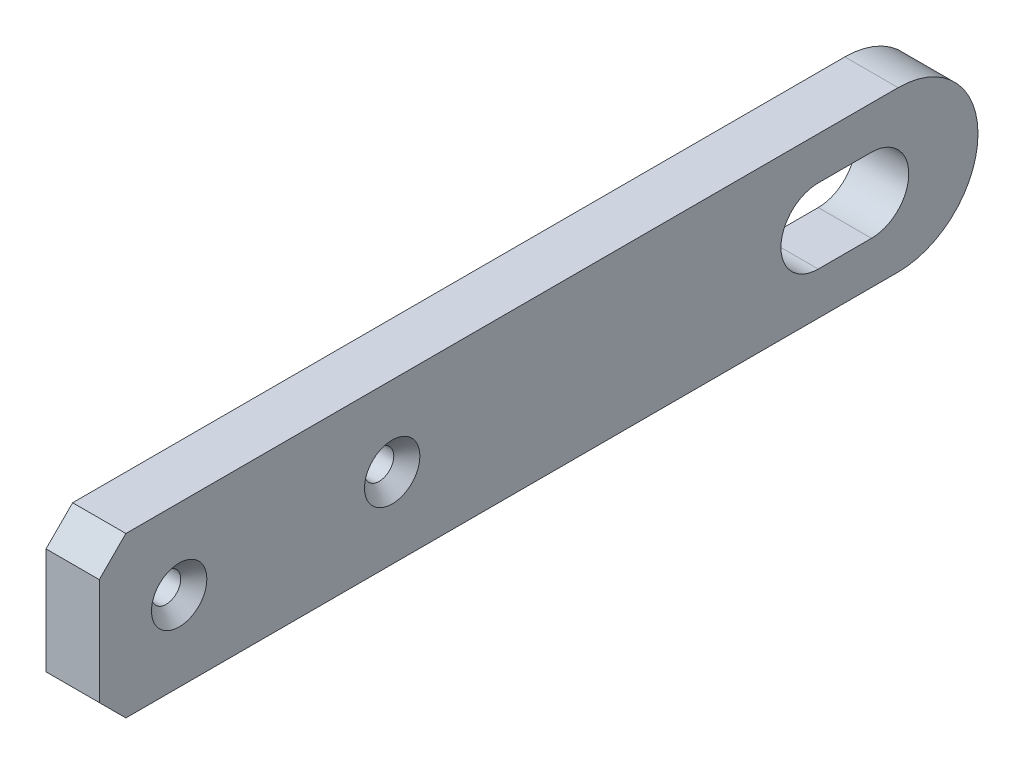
ISO-10303-21;
HEADER;
FILE_DESCRIPTION(('STEP AP214'),'2;1');
FILE_NAME('part.step','',(''),(''),'','','');
FILE_SCHEMA(('AUTOMOTIVE_DESIGN { 1 0 10303 214 1 1 1 1 }'));
ENDSEC;
DATA;
#1=APPLICATION_CONTEXT('core data for automotive mechanical design processes');
#2=APPLICATION_PROTOCOL_DEFINITION('international standard','automotive_design',2000,#1);
#3=PRODUCT_CONTEXT('',#1,'mechanical');
#4=PRODUCT('Part','Part','',(#3));
#5=PRODUCT_RELATED_PRODUCT_CATEGORY('part','',(#4));
#6=PRODUCT_DEFINITION_FORMATION('','',#4);
#7=PRODUCT_DEFINITION_CONTEXT('part definition',#1,'design');
#8=PRODUCT_DEFINITION('design','',#6,#7);
#9=PRODUCT_DEFINITION_SHAPE('','',#8);
#10=(LENGTH_UNIT() NAMED_UNIT(*) SI_UNIT(.MILLI.,.METRE.));
#11=(NAMED_UNIT(*) PLANE_ANGLE_UNIT() SI_UNIT($,.RADIAN.));
#12=(NAMED_UNIT(*) SI_UNIT($,.STERADIAN.) SOLID_ANGLE_UNIT());
#13=UNCERTAINTY_MEASURE_WITH_UNIT(LENGTH_MEASURE(1.E-05),#10,'distance_accuracy_value','');
#14=(GEOMETRIC_REPRESENTATION_CONTEXT(3) GLOBAL_UNCERTAINTY_ASSIGNED_CONTEXT((#13)) GLOBAL_UNIT_ASSIGNED_CONTEXT((#10,
#11,#12)) REPRESENTATION_CONTEXT('',''));
#15=CARTESIAN_POINT('',(0.,0.,0.));
#16=DIRECTION('',(0.,0.,1.));
#17=DIRECTION('',(1.,0.,0.));
#18=AXIS2_PLACEMENT_3D('',#15,#16,#17);
#19=CARTESIAN_POINT('',(6.00000000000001,-5.25947139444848,-317.315712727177));
#20=DIRECTION('',(0.,1.,0.));
#21=DIRECTION('',(0.,0.,1.));
#22=AXIS2_PLACEMENT_3D('',#19,#20,#21);
#23=PLANE('',#22);
#24=DIRECTION('',(-1.,0.,0.));
#25=VECTOR('',#24,1.);
#26=CARTESIAN_POINT('',(6.00000000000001,-5.25947139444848,-327.315712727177));
#27=LINE('',#26,#25);
#28=CARTESIAN_POINT('',(0.964159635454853,-5.25947139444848,-327.315712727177));
#29=VERTEX_POINT('',#28);
#30=CARTESIAN_POINT('',(-3.99999999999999,-5.25947139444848,-327.315712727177));
#31=VERTEX_POINT('',#30);
#32=EDGE_CURVE('E148',#29,#31,#27,.T.);
#33=ORIENTED_EDGE('',*,*,#32,.F.);
#34=DIRECTION('',(0.,0.,1.));
#35=VECTOR('',#34,1.);
#36=CARTESIAN_POINT('',(0.964159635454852,-5.25947139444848,-302.758317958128));
#37=LINE('',#36,#35);
#38=CARTESIAN_POINT('',(0.964159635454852,-5.25947139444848,-317.315712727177));
#39=VERTEX_POINT('',#38);
#40=EDGE_CURVE('E127',#29,#39,#37,.T.);
#41=ORIENTED_EDGE('',*,*,#40,.T.);
#42=DIRECTION('',(-1.,0.,0.));
#43=VECTOR('',#42,1.);
#44=CARTESIAN_POINT('',(6.00000000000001,-5.25947139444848,-317.315712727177));
#45=LINE('',#44,#43);
#46=CARTESIAN_POINT('',(-3.99999999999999,-5.25947139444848,-317.315712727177));
#47=VERTEX_POINT('',#46);
#48=EDGE_CURVE('E158',#39,#47,#45,.T.);
#49=ORIENTED_EDGE('',*,*,#48,.T.);
#50=DIRECTION('',(0.,0.,-1.));
#51=VECTOR('',#50,1.);
#52=CARTESIAN_POINT('',(-3.99999999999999,-5.25947139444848,-317.315712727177));
#53=LINE('',#52,#51);
#54=EDGE_CURVE('E155',#47,#31,#53,.T.);
#55=ORIENTED_EDGE('',*,*,#54,.T.);
#56=EDGE_LOOP('',(#33,#41,#49,#55));
#57=FACE_BOUND('',#56,.T.);
#58=ADVANCED_FACE('F33',(#57),#23,.F.);
#59=CARTESIAN_POINT('',(-3.99999999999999,-12.2594713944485,-332.315712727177));
#60=DIRECTION('',(1.,0.,0.));
#61=DIRECTION('',(0.,0.,-1.));
#62=AXIS2_PLACEMENT_3D('',#59,#60,#61);
#63=CYLINDRICAL_SURFACE('',#62,15.);
#64=CARTESIAN_POINT('',(5.04999999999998,-5.50000000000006,-345.706364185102));
#65=CARTESIAN_POINT('',(5.04999921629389,-5.61966680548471,-345.766771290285));
#66=CARTESIAN_POINT('',(5.0395139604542,-5.74015633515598,-345.825563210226));
#67=CARTESIAN_POINT('',(4.99683186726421,-5.97950495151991,-345.938469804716));
#68=CARTESIAN_POINT('',(4.96464119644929,-6.09836449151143,-345.992585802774));
#69=CARTESIAN_POINT('',(4.87809843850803,-6.33109425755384,-346.095066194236));
#70=CARTESIAN_POINT('',(4.8236549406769,-6.44494173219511,-346.143405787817));
#71=CARTESIAN_POINT('',(4.69315955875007,-6.66266729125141,-346.232955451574));
#72=CARTESIAN_POINT('',(4.61711540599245,-6.76654892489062,-346.274168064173));
#73=CARTESIAN_POINT('',(4.45189059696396,-6.95214614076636,-346.345731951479));
#74=CARTESIAN_POINT('',(4.36420231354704,-7.03495986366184,-346.376680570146));
#75=CARTESIAN_POINT('',(4.17424353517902,-7.18471289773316,-346.431420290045));
#76=CARTESIAN_POINT('',(4.07197971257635,-7.25165943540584,-346.455214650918));
#77=CARTESIAN_POINT('',(3.86383422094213,-7.36257631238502,-346.493993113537));
#78=CARTESIAN_POINT('',(3.75874191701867,-7.40785297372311,-346.509487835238));
#79=CARTESIAN_POINT('',(3.54181305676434,-7.48040586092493,-346.534081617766));
#80=CARTESIAN_POINT('',(3.42997818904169,-7.5076865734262,-346.543182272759));
#81=CARTESIAN_POINT('',(3.20724181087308,-7.54249472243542,-346.554759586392));
#82=CARTESIAN_POINT('',(3.09646109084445,-7.55072102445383,-346.557470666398));
#83=CARTESIAN_POINT('',(2.87504375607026,-7.54917995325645,-346.556961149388));
#84=CARTESIAN_POINT('',(2.76440712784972,-7.53941440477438,-346.553741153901));
#85=CARTESIAN_POINT('',(2.54767494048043,-7.50246267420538,-346.541437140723));
#86=CARTESIAN_POINT('',(2.44154302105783,-7.4754675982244,-346.532417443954));
#87=CARTESIAN_POINT('',(2.2355005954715,-7.40522646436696,-346.508586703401));
#88=CARTESIAN_POINT('',(2.13559005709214,-7.36198049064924,-346.493775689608));
#89=CARTESIAN_POINT('',(1.94370756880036,-7.26029827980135,-346.458243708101));
#90=CARTESIAN_POINT('',(1.85182210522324,-7.20171864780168,-346.437466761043));
#91=CARTESIAN_POINT('',(1.67936848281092,-7.07165577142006,-346.39020540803));
#92=CARTESIAN_POINT('',(1.59880142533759,-7.00017127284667,-346.36372044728));
#93=CARTESIAN_POINT('',(1.4482985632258,-6.84419045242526,-346.304347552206));
#94=CARTESIAN_POINT('',(1.3787968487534,-6.75934492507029,-346.271278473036));
#95=CARTESIAN_POINT('',(1.25497448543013,-6.58127562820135,-346.199779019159));
#96=CARTESIAN_POINT('',(1.20065732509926,-6.48804993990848,-346.161347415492));
#97=CARTESIAN_POINT('',(1.10500449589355,-6.29012544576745,-346.07722238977));
#98=CARTESIAN_POINT('',(1.06466543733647,-6.1850736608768,-346.031228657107));
#99=CARTESIAN_POINT('',(1.00191761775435,-5.97174574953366,-345.934751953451));
#100=CARTESIAN_POINT('',(0.979515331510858,-5.86346847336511,-345.884267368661));
#101=CARTESIAN_POINT('',(0.95112881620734,-5.63696420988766,-345.775263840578));
#102=CARTESIAN_POINT('',(0.946740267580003,-5.51869016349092,-345.716427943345));
#103=CARTESIAN_POINT('',(0.95798582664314,-5.28450625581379,-345.596045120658));
#104=CARTESIAN_POINT('',(0.973627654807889,-5.1685973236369,-345.534497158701));
#105=CARTESIAN_POINT('',(1.02629302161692,-4.93169752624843,-345.40477345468));
#106=CARTESIAN_POINT('',(1.06507272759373,-4.81115352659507,-345.336490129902));
#107=CARTESIAN_POINT('',(1.16432700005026,-4.57869939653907,-345.200738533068));
#108=CARTESIAN_POINT('',(1.22482012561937,-4.46679675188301,-345.13327100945));
#109=CARTESIAN_POINT('',(1.3689333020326,-4.25120809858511,-344.999730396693));
#110=CARTESIAN_POINT('',(1.45323792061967,-4.147904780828,-344.93377293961));
#111=CARTESIAN_POINT('',(1.64303645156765,-3.95755248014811,-344.809352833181));
#112=CARTESIAN_POINT('',(1.74849351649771,-3.87047573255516,-344.750877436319));
#113=CARTESIAN_POINT('',(1.94691790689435,-3.73831137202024,-344.660525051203));
#114=CARTESIAN_POINT('',(2.03528677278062,-3.68826956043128,-344.625762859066));
#115=CARTESIAN_POINT('',(2.2208610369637,-3.60107287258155,-344.564589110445));
#116=CARTESIAN_POINT('',(2.3180588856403,-3.56390711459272,-344.53817050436));
#117=CARTESIAN_POINT('',(2.51979764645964,-3.50424561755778,-344.495507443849));
#118=CARTESIAN_POINT('',(2.62438354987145,-3.48185022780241,-344.479332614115));
#119=CARTESIAN_POINT('',(2.83691267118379,-3.45369430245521,-344.458966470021));
#120=CARTESIAN_POINT('',(2.94485383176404,-3.44792376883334,-344.454767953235));
#121=CARTESIAN_POINT('',(3.14795907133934,-3.45310977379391,-344.458528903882));
#122=CARTESIAN_POINT('',(3.2432010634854,-3.46226647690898,-344.465180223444));
#123=CARTESIAN_POINT('',(3.43041100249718,-3.49344782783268,-344.487696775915));
#124=CARTESIAN_POINT('',(3.52237875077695,-3.5154732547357,-344.503562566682));
#125=CARTESIAN_POINT('',(3.70102059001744,-3.57130631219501,-344.543425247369));
#126=CARTESIAN_POINT('',(3.78768040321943,-3.60514421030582,-344.567443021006));
#127=CARTESIAN_POINT('',(3.95391994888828,-3.68314079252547,-344.62216706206));
#128=CARTESIAN_POINT('',(4.0334971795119,-3.72730310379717,-344.652875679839));
#129=CARTESIAN_POINT('',(4.19468829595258,-3.83099191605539,-344.723983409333));
#130=CARTESIAN_POINT('',(4.27515665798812,-3.89178231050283,-344.765128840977));
#131=CARTESIAN_POINT('',(4.42495212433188,-4.02286315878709,-344.852238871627));
#132=CARTESIAN_POINT('',(4.49427249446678,-4.09315930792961,-344.898206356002));
#133=CARTESIAN_POINT('',(4.63256613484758,-4.25482653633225,-345.001784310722));
#134=CARTESIAN_POINT('',(4.69929570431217,-4.34772394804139,-345.060013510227));
#135=CARTESIAN_POINT('',(4.81604513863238,-4.54220999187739,-345.178717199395));
#136=CARTESIAN_POINT('',(4.86605297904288,-4.64380481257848,-345.239193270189));
#137=CARTESIAN_POINT('',(4.95416351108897,-4.86751587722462,-345.368596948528));
#138=CARTESIAN_POINT('',(4.9898187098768,-4.99056958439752,-345.437585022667));
#139=CARTESIAN_POINT('',(5.03773595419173,-5.24209513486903,-345.573799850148));
#140=CARTESIAN_POINT('',(5.05000084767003,-5.37056631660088,-345.641026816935));
#141=CARTESIAN_POINT('',(5.04999999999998,-5.50000000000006,-345.706364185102));
#142=B_SPLINE_CURVE_WITH_KNOTS('',3,(#64,#65,#66,#67,#68,#69,#70,#71,#72,#73,#74,#75,#76,#77,
#78,#79,#80,#81,#82,#83,#84,#85,#86,#87,#88,#89,#90,#91,#92,#93,#94,#95,#96,#97,#98,#99,#100,
#101,#102,#103,#104,#105,#106,#107,#108,#109,#110,#111,#112,#113,#114,#115,#116,#117,#118,#119,
#120,#121,#122,#123,#124,#125,#126,#127,#128,#129,#130,#131,#132,#133,#134,#135,#136,#137,#138,
#139,#140,#141),.UNSPECIFIED.,.T.,.F.,(4,2,2,2,2,2,2,2,2,2,2,2,2,2,2,2,2,2,2,2,2,2,2,2,2,2,2,2,
2,2,2,2,2,2,2,2,2,2,4),(0.,0.401696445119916,0.803278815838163,1.20652766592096,
1.60963236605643,1.98121315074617,2.35262437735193,2.69731942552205,3.04192850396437,
3.37368320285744,3.70540425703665,4.03350840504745,4.36161085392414,4.692898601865,
5.02421856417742,5.36637891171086,5.70861780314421,6.07177906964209,6.43507137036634,
6.82992980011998,7.22494046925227,7.6546210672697,8.08466980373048,8.52862433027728,
8.97181210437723,9.29256060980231,9.61303738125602,9.93566962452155,10.258107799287,
10.5444581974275,10.8308259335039,11.1179328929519,11.40514087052,11.7306787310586,
12.0564125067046,12.43993877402,12.8237402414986,13.2582749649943,13.6927567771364),.UNSPECIFIED.);
#143=CARTESIAN_POINT('',(5.04999999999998,-5.50000000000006,-345.706364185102));
#144=VERTEX_POINT('',#143);
#145=EDGE_CURVE('E215',#144,#144,#142,.T.);
#146=ORIENTED_EDGE('',*,*,#145,.F.);
#147=EDGE_LOOP('',(#146));
#148=FACE_BOUND('',#147,.T.);
#149=CARTESIAN_POINT('',(6.00000000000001,-12.2594713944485,-332.315712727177));
#150=DIRECTION('',(1.,0.,0.));
#151=DIRECTION('',(0.,0.,-1.));
#152=AXIS2_PLACEMENT_3D('',#149,#150,#151);
#153=CIRCLE('',#152,15.);
#154=CARTESIAN_POINT('',(6.00000000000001,-27.2594713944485,-332.315712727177));
#155=VERTEX_POINT('',#154);
#156=CARTESIAN_POINT('',(6.00000000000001,2.74052860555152,-332.315712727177));
#157=VERTEX_POINT('',#156);
#158=EDGE_CURVE('E147',#155,#157,#153,.T.);
#159=ORIENTED_EDGE('',*,*,#158,.F.);
#160=DIRECTION('',(1.,0.,0.));
#161=VECTOR('',#160,1.);
#162=CARTESIAN_POINT('',(-3.99999999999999,-27.2594713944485,-332.315712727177));
#163=LINE('',#162,#161);
#164=CARTESIAN_POINT('',(-3.99999999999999,-27.2594713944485,-332.315712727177));
#165=VERTEX_POINT('',#164);
#166=EDGE_CURVE('E132',#165,#155,#163,.T.);
#167=ORIENTED_EDGE('',*,*,#166,.F.);
#168=CARTESIAN_POINT('',(-3.99999999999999,-12.2594713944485,-332.315712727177));
#169=DIRECTION('',(1.,0.,0.));
#170=DIRECTION('',(0.,0.,-1.));
#171=AXIS2_PLACEMENT_3D('',#168,#169,#170);
#172=CIRCLE('',#171,15.);
#173=CARTESIAN_POINT('',(-3.99999999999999,2.74052860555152,-332.315712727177));
#174=VERTEX_POINT('',#173);
#175=EDGE_CURVE('E165',#165,#174,#172,.T.);
#176=ORIENTED_EDGE('',*,*,#175,.T.);
#177=DIRECTION('',(1.,0.,0.));
#178=VECTOR('',#177,1.);
#179=CARTESIAN_POINT('',(-3.99999999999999,2.74052860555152,-332.315712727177));
#180=LINE('',#179,#178);
#181=EDGE_CURVE('E175',#174,#157,#180,.T.);
#182=ORIENTED_EDGE('',*,*,#181,.T.);
#183=EDGE_LOOP('',(#159,#167,#176,#182));
#184=FACE_BOUND('',#183,.T.);
#185=ADVANCED_FACE('F230',(#148,#184),#63,.T.);
#186=CARTESIAN_POINT('',(-3.99999999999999,-27.2594713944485,-182.315712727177));
#187=DIRECTION('',(0.,-1.,0.));
#188=DIRECTION('',(0.,0.,-1.));
#189=AXIS2_PLACEMENT_3D('',#186,#187,#188);
#190=PLANE('',#189);
#191=DIRECTION('',(0.,0.,-1.));
#192=VECTOR('',#191,1.);
#193=CARTESIAN_POINT('',(6.00000000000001,-27.2594713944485,-182.315712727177));
#194=LINE('',#193,#192);
#195=CARTESIAN_POINT('',(6.00000000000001,-27.2594713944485,-187.315712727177));
#196=VERTEX_POINT('',#195);
#197=EDGE_CURVE('E169',#196,#155,#194,.T.);
#198=ORIENTED_EDGE('',*,*,#197,.F.);
#199=DIRECTION('',(-1.,0.,0.));
#200=VECTOR('',#199,1.);
#201=CARTESIAN_POINT('',(-3.99999999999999,-27.2594713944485,-187.315712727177));
#202=LINE('',#201,#200);
#203=CARTESIAN_POINT('',(-3.99999999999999,-27.2594713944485,-187.315712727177));
#204=VERTEX_POINT('',#203);
#205=EDGE_CURVE('E11',#196,#204,#202,.T.);
#206=ORIENTED_EDGE('',*,*,#205,.T.);
#207=DIRECTION('',(0.,0.,-1.));
#208=VECTOR('',#207,1.);
#209=CARTESIAN_POINT('',(-3.99999999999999,-27.2594713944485,-182.315712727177));
#210=LINE('',#209,#208);
#211=EDGE_CURVE('E174',#204,#165,#210,.T.);
#212=ORIENTED_EDGE('',*,*,#211,.T.);
#213=ORIENTED_EDGE('',*,*,#166,.T.);
#214=EDGE_LOOP('',(#198,#206,#212,#213));
#215=FACE_BOUND('',#214,.T.);
#216=ADVANCED_FACE('F235',(#215),#190,.T.);
#217=CARTESIAN_POINT('',(-3.99999999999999,2.7405286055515,-182.315712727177));
#218=DIRECTION('',(0.,0.,1.));
#219=DIRECTION('',(1.,0.,0.));
#220=AXIS2_PLACEMENT_3D('',#217,#218,#219);
#221=PLANE('',#220);
#222=DIRECTION('',(0.,-1.,0.));
#223=VECTOR('',#222,1.);
#224=CARTESIAN_POINT('',(6.00000000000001,2.7405286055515,-182.315712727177));
#225=LINE('',#224,#223);
#226=CARTESIAN_POINT('',(6.00000000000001,-2.25947139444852,-182.315712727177));
#227=VERTEX_POINT('',#226);
#228=CARTESIAN_POINT('',(6.00000000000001,-22.2594713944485,-182.315712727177));
#229=VERTEX_POINT('',#228);
#230=EDGE_CURVE('E179',#227,#229,#225,.T.);
#231=ORIENTED_EDGE('',*,*,#230,.F.);
#232=DIRECTION('',(-1.,0.,0.));
#233=VECTOR('',#232,1.);
#234=CARTESIAN_POINT('',(-3.99999999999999,-2.25947139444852,-182.315712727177));
#235=LINE('',#234,#233);
#236=CARTESIAN_POINT('',(-3.99999999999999,-2.25947139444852,-182.315712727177));
#237=VERTEX_POINT('',#236);
#238=EDGE_CURVE('E280',#227,#237,#235,.T.);
#239=ORIENTED_EDGE('',*,*,#238,.T.);
#240=DIRECTION('',(0.,-1.,0.));
#241=VECTOR('',#240,1.);
#242=CARTESIAN_POINT('',(-3.99999999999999,2.7405286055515,-182.315712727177));
#243=LINE('',#242,#241);
#244=CARTESIAN_POINT('',(-3.99999999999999,-22.2594713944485,-182.315712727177));
#245=VERTEX_POINT('',#244);
#246=EDGE_CURVE('E172',#237,#245,#243,.T.);
#247=ORIENTED_EDGE('',*,*,#246,.T.);
#248=DIRECTION('',(1.,0.,0.));
#249=VECTOR('',#248,1.);
#250=CARTESIAN_POINT('',(-3.99999999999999,-22.2594713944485,-182.315712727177));
#251=LINE('',#250,#249);
#252=EDGE_CURVE('E286',#245,#229,#251,.T.);
#253=ORIENTED_EDGE('',*,*,#252,.T.);
#254=EDGE_LOOP('',(#231,#239,#247,#253));
#255=FACE_BOUND('',#254,.T.);
#256=ADVANCED_FACE('F258',(#255),#221,.T.);
#257=CARTESIAN_POINT('',(-3.99999999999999,2.74052860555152,-332.315712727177));
#258=DIRECTION('',(0.,1.,0.));
#259=DIRECTION('',(0.,0.,1.));
#260=AXIS2_PLACEMENT_3D('',#257,#258,#259);
#261=PLANE('',#260);
#262=DIRECTION('',(0.,0.,1.));
#263=VECTOR('',#262,1.);
#264=CARTESIAN_POINT('',(-3.99999999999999,2.74052860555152,-332.315712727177));
#265=LINE('',#264,#263);
#266=CARTESIAN_POINT('',(-3.99999999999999,2.7405286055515,-187.315712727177));
#267=VERTEX_POINT('',#266);
#268=EDGE_CURVE('E168',#174,#267,#265,.T.);
#269=ORIENTED_EDGE('',*,*,#268,.T.);
#270=DIRECTION('',(1.,0.,0.));
#271=VECTOR('',#270,1.);
#272=CARTESIAN_POINT('',(-3.99999999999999,2.7405286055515,-187.315712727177));
#273=LINE('',#272,#271);
#274=CARTESIAN_POINT('',(6.00000000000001,2.7405286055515,-187.315712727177));
#275=VERTEX_POINT('',#274);
#276=EDGE_CURVE('E131',#267,#275,#273,.T.);
#277=ORIENTED_EDGE('',*,*,#276,.T.);
#278=DIRECTION('',(0.,0.,1.));
#279=VECTOR('',#278,1.);
#280=CARTESIAN_POINT('',(6.00000000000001,2.74052860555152,-332.315712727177));
#281=LINE('',#280,#279);
#282=EDGE_CURVE('E151',#157,#275,#281,.T.);
#283=ORIENTED_EDGE('',*,*,#282,.F.);
#284=ORIENTED_EDGE('',*,*,#181,.F.);
#285=EDGE_LOOP('',(#269,#277,#283,#284));
#286=FACE_BOUND('',#285,.T.);
#287=ADVANCED_FACE('F251',(#286),#261,.T.);
#288=CARTESIAN_POINT('',(-3.99999999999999,-12.2594713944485,-332.315712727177));
#289=DIRECTION('',(1.,0.,0.));
#290=DIRECTION('',(0.,0.,-1.));
#291=AXIS2_PLACEMENT_3D('',#288,#289,#290);
#292=PLANE('',#291);
#293=CARTESIAN_POINT('',(-3.99999999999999,-12.2594713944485,-197.315712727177));
#294=DIRECTION('',(1.,0.,0.));
#295=DIRECTION('',(0.,0.,-1.));
#296=AXIS2_PLACEMENT_3D('',#293,#294,#295);
#297=CIRCLE('',#296,2.74999999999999);
#298=CARTESIAN_POINT('',(-3.99999999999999,-12.2594713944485,-200.065712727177));
#299=VERTEX_POINT('',#298);
#300=EDGE_CURVE('E320',#299,#299,#297,.T.);
#301=ORIENTED_EDGE('',*,*,#300,.T.);
#302=EDGE_LOOP('',(#301));
#303=FACE_BOUND('',#302,.T.);
#304=CARTESIAN_POINT('',(-3.99999999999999,-12.2594713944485,-237.315712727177));
#305=DIRECTION('',(1.,0.,0.));
#306=DIRECTION('',(0.,0.,-1.));
#307=AXIS2_PLACEMENT_3D('',#304,#305,#306);
#308=CIRCLE('',#307,2.74999999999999);
#309=CARTESIAN_POINT('',(-3.99999999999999,-12.2594713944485,-240.065712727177));
#310=VERTEX_POINT('',#309);
#311=EDGE_CURVE('E322',#310,#310,#308,.T.);
#312=ORIENTED_EDGE('',*,*,#311,.T.);
#313=EDGE_LOOP('',(#312));
#314=FACE_BOUND('',#313,.T.);
#315=DIRECTION('',(0.,0.,1.));
#316=VECTOR('',#315,1.);
#317=CARTESIAN_POINT('',(-3.99999999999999,-19.2594713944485,-327.315712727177));
#318=LINE('',#317,#316);
#319=CARTESIAN_POINT('',(-3.99999999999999,-19.2594713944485,-327.315712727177));
#320=VERTEX_POINT('',#319);
#321=CARTESIAN_POINT('',(-3.99999999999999,-19.2594713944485,-317.315712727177));
#322=VERTEX_POINT('',#321);
#323=EDGE_CURVE('E441',#320,#322,#318,.T.);
#324=ORIENTED_EDGE('',*,*,#323,.F.);
#325=CARTESIAN_POINT('',(-3.99999999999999,-12.2594713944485,-327.315712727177));
#326=DIRECTION('',(-1.,0.,0.));
#327=DIRECTION('',(0.,0.,1.));
#328=AXIS2_PLACEMENT_3D('',#325,#326,#327);
#329=CIRCLE('',#328,7.00000000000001);
#330=EDGE_CURVE('E443',#31,#320,#329,.T.);
#331=ORIENTED_EDGE('',*,*,#330,.F.);
#332=ORIENTED_EDGE('',*,*,#54,.F.);
#333=CARTESIAN_POINT('',(-3.99999999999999,-12.2594713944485,-317.315712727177));
#334=DIRECTION('',(-1.,0.,0.));
#335=DIRECTION('',(0.,0.,1.));
#336=AXIS2_PLACEMENT_3D('',#333,#334,#335);
#337=CIRCLE('',#336,7.);
#338=EDGE_CURVE('E445',#322,#47,#337,.T.);
#339=ORIENTED_EDGE('',*,*,#338,.F.);
#340=EDGE_LOOP('',(#324,#331,#332,#339));
#341=FACE_BOUND('',#340,.T.);
#342=ORIENTED_EDGE('',*,*,#246,.F.);
#343=DIRECTION('',(0.,-0.70710678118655,0.707106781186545));
#344=VECTOR('',#343,1.);
#345=CARTESIAN_POINT('',(-3.99999999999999,2.7405286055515,-187.315712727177));
#346=LINE('',#345,#344);
#347=EDGE_CURVE('E41',#237,#267,#346,.F.);
#348=ORIENTED_EDGE('',*,*,#347,.T.);
#349=ORIENTED_EDGE('',*,*,#268,.F.);
#350=ORIENTED_EDGE('',*,*,#175,.F.);
#351=ORIENTED_EDGE('',*,*,#211,.F.);
#352=DIRECTION('',(0.,-0.707106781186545,-0.70710678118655));
#353=VECTOR('',#352,1.);
#354=CARTESIAN_POINT('',(-3.99999999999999,-22.2594713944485,-182.315712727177));
#355=LINE('',#354,#353);
#356=EDGE_CURVE('E53',#204,#245,#355,.F.);
#357=ORIENTED_EDGE('',*,*,#356,.T.);
#358=EDGE_LOOP('',(#342,#348,#349,#350,#351,#357));
#359=FACE_BOUND('',#358,.T.);
#360=ADVANCED_FACE('F245',(#303,#314,#341,#359),#292,.F.);
#361=CARTESIAN_POINT('',(6.00000000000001,-12.2594713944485,-332.315712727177));
#362=DIRECTION('',(1.,0.,0.));
#363=DIRECTION('',(0.,0.,-1.));
#364=AXIS2_PLACEMENT_3D('',#361,#362,#363);
#365=PLANE('',#364);
#366=CARTESIAN_POINT('',(6.00000000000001,-12.2594713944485,-197.315712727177));
#367=DIRECTION('',(1.,0.,0.));
#368=DIRECTION('',(0.,0.,-1.));
#369=AXIS2_PLACEMENT_3D('',#366,#367,#368);
#370=CIRCLE('',#369,5.20000000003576);
#371=CARTESIAN_POINT('',(6.00000000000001,-12.2594713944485,-202.515712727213));
#372=VERTEX_POINT('',#371);
#373=EDGE_CURVE('E464',#372,#372,#370,.T.);
#374=ORIENTED_EDGE('',*,*,#373,.F.);
#375=EDGE_LOOP('',(#374));
#376=FACE_BOUND('',#375,.T.);
#377=CARTESIAN_POINT('',(6.00000000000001,-12.2594713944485,-237.315712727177));
#378=DIRECTION('',(1.,0.,0.));
#379=DIRECTION('',(0.,0.,-1.));
#380=AXIS2_PLACEMENT_3D('',#377,#378,#379);
#381=CIRCLE('',#380,5.20000000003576);
#382=CARTESIAN_POINT('',(6.00000000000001,-12.2594713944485,-242.515712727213));
#383=VERTEX_POINT('',#382);
#384=EDGE_CURVE('E319',#383,#383,#381,.T.);
#385=ORIENTED_EDGE('',*,*,#384,.F.);
#386=EDGE_LOOP('',(#385));
#387=FACE_BOUND('',#386,.T.);
#388=CARTESIAN_POINT('',(6.00000000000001,-12.2594713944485,-327.315712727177));
#389=DIRECTION('',(-1.,0.,0.));
#390=DIRECTION('',(0.,0.,1.));
#391=AXIS2_PLACEMENT_3D('',#388,#389,#390);
#392=CIRCLE('',#391,7.00000000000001);
#393=CARTESIAN_POINT('',(6.00000000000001,-5.25947139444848,-327.315712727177));
#394=VERTEX_POINT('',#393);
#395=CARTESIAN_POINT('',(6.00000000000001,-19.2594713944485,-327.315712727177));
#396=VERTEX_POINT('',#395);
#397=EDGE_CURVE('E145',#394,#396,#392,.T.);
#398=ORIENTED_EDGE('',*,*,#397,.T.);
#399=DIRECTION('',(0.,0.,1.));
#400=VECTOR('',#399,1.);
#401=CARTESIAN_POINT('',(6.00000000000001,-19.2594713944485,-327.315712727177));
#402=LINE('',#401,#400);
#403=CARTESIAN_POINT('',(6.00000000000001,-19.2594713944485,-317.315712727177));
#404=VERTEX_POINT('',#403);
#405=EDGE_CURVE('E454',#396,#404,#402,.T.);
#406=ORIENTED_EDGE('',*,*,#405,.T.);
#407=CARTESIAN_POINT('',(6.00000000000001,-12.2594713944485,-317.315712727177));
#408=DIRECTION('',(-1.,0.,0.));
#409=DIRECTION('',(0.,0.,1.));
#410=AXIS2_PLACEMENT_3D('',#407,#408,#409);
#411=CIRCLE('',#410,7.);
#412=CARTESIAN_POINT('',(6.00000000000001,-5.25947139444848,-317.315712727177));
#413=VERTEX_POINT('',#412);
#414=EDGE_CURVE('E451',#404,#413,#411,.T.);
#415=ORIENTED_EDGE('',*,*,#414,.T.);
#416=DIRECTION('',(0.,0.,-1.));
#417=VECTOR('',#416,1.);
#418=CARTESIAN_POINT('',(6.00000000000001,-5.25947139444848,-317.315712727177));
#419=LINE('',#418,#417);
#420=EDGE_CURVE('E164',#413,#394,#419,.T.);
#421=ORIENTED_EDGE('',*,*,#420,.T.);
#422=EDGE_LOOP('',(#398,#406,#415,#421));
#423=FACE_BOUND('',#422,.T.);
#424=ORIENTED_EDGE('',*,*,#282,.T.);
#425=DIRECTION('',(0.,0.70710678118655,-0.707106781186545));
#426=VECTOR('',#425,1.);
#427=CARTESIAN_POINT('',(6.00000000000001,67.7405286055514,-252.315712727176));
#428=LINE('',#427,#426);
#429=EDGE_CURVE('E289',#275,#227,#428,.F.);
#430=ORIENTED_EDGE('',*,*,#429,.T.);
#431=ORIENTED_EDGE('',*,*,#230,.T.);
#432=DIRECTION('',(0.,0.707106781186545,0.70710678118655));
#433=VECTOR('',#432,1.);
#434=CARTESIAN_POINT('',(6.00000000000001,-92.2594713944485,-252.315712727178));
#435=LINE('',#434,#433);
#436=EDGE_CURVE('E290',#229,#196,#435,.F.);
#437=ORIENTED_EDGE('',*,*,#436,.T.);
#438=ORIENTED_EDGE('',*,*,#197,.T.);
#439=ORIENTED_EDGE('',*,*,#158,.T.);
#440=EDGE_LOOP('',(#424,#430,#431,#437,#438,#439));
#441=FACE_BOUND('',#440,.T.);
#442=ADVANCED_FACE('F241',(#376,#387,#423,#441),#365,.T.);
#443=CARTESIAN_POINT('',(6.00000000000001,-12.2594713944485,-327.315712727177));
#444=DIRECTION('',(-1.,0.,0.));
#445=DIRECTION('',(0.,0.,1.));
#446=AXIS2_PLACEMENT_3D('',#443,#444,#445);
#447=CYLINDRICAL_SURFACE('',#446,7.00000000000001);
#448=CARTESIAN_POINT('',(5.03584036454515,-5.25947139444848,-327.315712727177));
#449=VERTEX_POINT('',#448);
#450=EDGE_CURVE('E138',#394,#449,#27,.T.);
#451=ORIENTED_EDGE('',*,*,#450,.T.);
#452=CARTESIAN_POINT('',(5.03584036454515,-5.25947139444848,-327.315712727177));
#453=CARTESIAN_POINT('',(5.03583226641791,-5.25947066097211,-327.402063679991));
#454=CARTESIAN_POINT('',(5.03602893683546,-5.26106920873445,-327.488413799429));
#455=CARTESIAN_POINT('',(5.03677286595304,-5.26745918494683,-327.660993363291));
#456=CARTESIAN_POINT('',(5.03732012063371,-5.27225057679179,-327.747222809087));
#457=CARTESIAN_POINT('',(5.03870643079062,-5.28502202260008,-327.919463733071));
#458=CARTESIAN_POINT('',(5.03954555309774,-5.29300280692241,-328.005475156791));
#459=CARTESIAN_POINT('',(5.04139651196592,-5.31214043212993,-328.177137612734));
#460=CARTESIAN_POINT('',(5.04240834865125,-5.32329727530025,-328.262788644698));
#461=CARTESIAN_POINT('',(5.04549591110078,-5.36170665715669,-328.520336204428));
#462=CARTESIAN_POINT('',(5.04760910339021,-5.39380252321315,-328.691535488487));
#463=CARTESIAN_POINT('',(5.05015000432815,-5.47066036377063,-329.031035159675));
#464=CARTESIAN_POINT('',(5.05057810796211,-5.51541936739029,-329.199336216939));
#465=CARTESIAN_POINT('',(5.04762194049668,-5.60655016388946,-329.496872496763));
#466=CARTESIAN_POINT('',(5.04502545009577,-5.65057520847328,-329.626836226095));
#467=CARTESIAN_POINT('',(5.03573605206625,-5.74614328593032,-329.883854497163));
#468=CARTESIAN_POINT('',(5.02904275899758,-5.79768702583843,-330.010908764));
#469=CARTESIAN_POINT('',(5.00980724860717,-5.90778490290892,-330.260992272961));
#470=CARTESIAN_POINT('',(4.9972853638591,-5.96631414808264,-330.384033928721));
#471=CARTESIAN_POINT('',(4.96431730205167,-6.08995491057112,-330.625617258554));
#472=CARTESIAN_POINT('',(4.94387551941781,-6.15506276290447,-330.744161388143));
#473=CARTESIAN_POINT('',(4.88735385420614,-6.30504462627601,-330.999594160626));
#474=CARTESIAN_POINT('',(4.84891819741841,-6.39122579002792,-331.135223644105));
#475=CARTESIAN_POINT('',(4.75208065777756,-6.56908217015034,-331.395439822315));
#476=CARTESIAN_POINT('',(4.69370179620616,-6.6607509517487,-331.520039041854));
#477=CARTESIAN_POINT('',(4.56878378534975,-6.82258420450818,-331.726290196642));
#478=CARTESIAN_POINT('',(4.50746782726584,-6.89269005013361,-331.811117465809));
#479=CARTESIAN_POINT('',(4.36848647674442,-7.02944734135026,-331.969500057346));
#480=CARTESIAN_POINT('',(4.29084392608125,-7.09610345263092,-332.043070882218));
#481=CARTESIAN_POINT('',(4.13614478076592,-7.2084681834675,-332.162640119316));
#482=CARTESIAN_POINT('',(4.06217541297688,-7.25568100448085,-332.21120345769));
#483=CARTESIAN_POINT('',(3.9040784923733,-7.34207462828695,-332.297977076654));
#484=CARTESIAN_POINT('',(3.81995456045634,-7.3812582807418,-332.336191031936));
#485=CARTESIAN_POINT('',(3.64259881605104,-7.44900775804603,-332.401150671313));
#486=CARTESIAN_POINT('',(3.54930928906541,-7.47750003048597,-332.427817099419));
#487=CARTESIAN_POINT('',(3.35695951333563,-7.52108432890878,-332.468245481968));
#488=CARTESIAN_POINT('',(3.25790238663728,-7.5361835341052,-332.482014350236));
#489=CARTESIAN_POINT('',(3.06936739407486,-7.5507500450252,-332.495289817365));
#490=CARTESIAN_POINT('',(2.98011240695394,-7.55182852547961,-332.496266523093));
#491=CARTESIAN_POINT('',(2.80274597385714,-7.54241737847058,-332.487699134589));
#492=CARTESIAN_POINT('',(2.71463418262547,-7.531931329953,-332.478158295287));
#493=CARTESIAN_POINT('',(2.54535377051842,-7.50073427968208,-332.44940948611));
#494=CARTESIAN_POINT('',(2.46404896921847,-7.48041366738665,-332.430570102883));
#495=CARTESIAN_POINT('',(2.30686668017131,-7.43102489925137,-332.383971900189));
#496=CARTESIAN_POINT('',(2.23098964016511,-7.40195602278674,-332.356212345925));
#497=CARTESIAN_POINT('',(2.08158407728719,-7.334702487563,-332.290547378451));
#498=CARTESIAN_POINT('',(2.00849027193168,-7.29606559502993,-332.252121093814));
#499=CARTESIAN_POINT('',(1.87092294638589,-7.21293878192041,-332.167109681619));
#500=CARTESIAN_POINT('',(1.80645431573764,-7.16844556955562,-332.120519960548));
#501=CARTESIAN_POINT('',(1.65872896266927,-7.05427399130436,-331.997144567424));
#502=CARTESIAN_POINT('',(1.58049575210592,-6.98243473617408,-331.916334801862));
#503=CARTESIAN_POINT('',(1.44185799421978,-6.83600862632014,-331.742787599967));
#504=CARTESIAN_POINT('',(1.38148928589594,-6.76141658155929,-331.650026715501));
#505=CARTESIAN_POINT('',(1.29003088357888,-6.63269823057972,-331.480762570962));
#506=CARTESIAN_POINT('',(1.25541030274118,-6.57829955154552,-331.406313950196));
#507=CARTESIAN_POINT('',(1.19356797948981,-6.47115031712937,-331.2532328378));
#508=CARTESIAN_POINT('',(1.16634993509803,-6.41840059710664,-331.174598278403));
#509=CARTESIAN_POINT('',(1.11822165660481,-6.31526365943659,-331.013758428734));
#510=CARTESIAN_POINT('',(1.09732205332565,-6.2648805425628,-330.931547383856));
#511=CARTESIAN_POINT('',(1.06086962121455,-6.16707922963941,-330.764213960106));
#512=CARTESIAN_POINT('',(1.0453186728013,-6.1196620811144,-330.679090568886));
#513=CARTESIAN_POINT('',(1.01002751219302,-5.99866892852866,-330.450701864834));
#514=CARTESIAN_POINT('',(0.994051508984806,-5.92793990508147,-330.305337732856));
#515=CARTESIAN_POINT('',(0.970458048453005,-5.79650256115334,-330.009463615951));
#516=CARTESIAN_POINT('',(0.962846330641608,-5.73580114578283,-329.858950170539));
#517=CARTESIAN_POINT('',(0.953049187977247,-5.62487958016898,-329.553703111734));
#518=CARTESIAN_POINT('',(0.950871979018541,-5.57467540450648,-329.398963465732));
#519=CARTESIAN_POINT('',(0.949564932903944,-5.48517847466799,-329.086411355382));
#520=CARTESIAN_POINT('',(0.950434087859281,-5.44588211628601,-328.928599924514));
#521=CARTESIAN_POINT('',(0.952975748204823,-5.38671833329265,-328.649967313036));
#522=CARTESIAN_POINT('',(0.954396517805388,-5.36444939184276,-328.529646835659));
#523=CARTESIAN_POINT('',(0.957287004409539,-5.32624755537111,-328.288012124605));
#524=CARTESIAN_POINT('',(0.958756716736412,-5.31031405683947,-328.166697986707));
#525=CARTESIAN_POINT('',(0.961275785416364,-5.28488335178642,-327.923944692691));
#526=CARTESIAN_POINT('',(0.962327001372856,-5.27535753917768,-327.802508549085));
#527=CARTESIAN_POINT('',(0.963785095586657,-5.26264965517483,-327.559286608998));
#528=CARTESIAN_POINT('',(0.964191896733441,-5.25946834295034,-327.43750077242));
#529=CARTESIAN_POINT('',(0.964159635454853,-5.25947139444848,-327.315712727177));
#530=B_SPLINE_CURVE_WITH_KNOTS('',3,(#452,#453,#454,#455,#456,#457,#458,#459,#460,#461,#462,
#463,#464,#465,#466,#467,#468,#469,#470,#471,#472,#473,#474,#475,#476,#477,#478,#479,#480,#481,
#482,#483,#484,#485,#486,#487,#488,#489,#490,#491,#492,#493,#494,#495,#496,#497,#498,#499,#500,
#501,#502,#503,#504,#505,#506,#507,#508,#509,#510,#511,#512,#513,#514,#515,#516,#517,#518,#519,
#520,#521,#522,#523,#524,#525,#526,#527,#528,#529),.UNSPECIFIED.,.F.,.F.,(4,2,2,2,2,2,2,2,2,2,2,
2,2,2,2,2,2,2,2,2,2,2,2,2,2,2,2,2,2,2,2,2,2,2,2,2,2,2,4),(0.,0.259036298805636,
0.518069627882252,0.77716230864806,1.03625517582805,1.55831721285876,2.08025687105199,
2.49171811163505,2.90321806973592,3.31329317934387,3.72314108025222,4.21751956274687,
4.71132928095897,5.08796668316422,5.46408061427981,5.76376317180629,6.0633391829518,
6.36493993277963,6.66637891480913,6.93282489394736,7.19918843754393,7.45575196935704,
7.71233664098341,7.98477357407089,8.25736430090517,8.65551122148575,9.05445155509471,
9.34953048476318,9.64475655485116,9.94047661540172,10.2363005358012,10.7228693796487,
11.2097718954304,11.6974100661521,12.1848869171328,12.5518455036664,12.9187691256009,
13.284043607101,13.6493617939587),.UNSPECIFIED.);
#531=EDGE_CURVE('E121',#449,#29,#530,.T.);
#532=ORIENTED_EDGE('',*,*,#531,.T.);
#533=ORIENTED_EDGE('',*,*,#32,.T.);
#534=ORIENTED_EDGE('',*,*,#330,.T.);
#535=DIRECTION('',(-1.,0.,0.));
#536=VECTOR('',#535,1.);
#537=CARTESIAN_POINT('',(6.00000000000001,-19.2594713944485,-327.315712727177));
#538=LINE('',#537,#536);
#539=EDGE_CURVE('E161',#396,#320,#538,.T.);
#540=ORIENTED_EDGE('',*,*,#539,.F.);
#541=ORIENTED_EDGE('',*,*,#397,.F.);
#542=EDGE_LOOP('',(#451,#532,#533,#534,#540,#541));
#543=FACE_BOUND('',#542,.T.);
#544=ADVANCED_FACE('F143',(#543),#447,.F.);
#545=CARTESIAN_POINT('',(5.03584036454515,-5.25947139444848,-317.315712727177));
#546=VERTEX_POINT('',#545);
#547=EDGE_CURVE('E140',#413,#546,#45,.T.);
#548=ORIENTED_EDGE('',*,*,#547,.T.);
#549=DIRECTION('',(0.,0.,1.));
#550=VECTOR('',#549,1.);
#551=CARTESIAN_POINT('',(5.03584036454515,-5.25947139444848,-302.758317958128));
#552=LINE('',#551,#550);
#553=EDGE_CURVE('E124',#546,#449,#552,.F.);
#554=ORIENTED_EDGE('',*,*,#553,.T.);
#555=ORIENTED_EDGE('',*,*,#450,.F.);
#556=ORIENTED_EDGE('',*,*,#420,.F.);
#557=EDGE_LOOP('',(#548,#554,#555,#556));
#558=FACE_BOUND('',#557,.T.);
#559=ADVANCED_FACE('F136',(#558),#23,.F.);
#560=CARTESIAN_POINT('',(6.00000000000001,-12.2594713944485,-317.315712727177));
#561=DIRECTION('',(-1.,0.,0.));
#562=DIRECTION('',(0.,0.,1.));
#563=AXIS2_PLACEMENT_3D('',#560,#561,#562);
#564=CYLINDRICAL_SURFACE('',#563,7.);
#565=ORIENTED_EDGE('',*,*,#48,.F.);
#566=CARTESIAN_POINT('',(0.964159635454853,-5.25947139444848,-317.315712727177));
#567=CARTESIAN_POINT('',(0.9641677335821,-5.25947066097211,-317.229361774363));
#568=CARTESIAN_POINT('',(0.963971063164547,-5.26106920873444,-317.143011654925));
#569=CARTESIAN_POINT('',(0.963227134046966,-5.26745918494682,-316.970432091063));
#570=CARTESIAN_POINT('',(0.962679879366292,-5.27225057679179,-316.884202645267));
#571=CARTESIAN_POINT('',(0.961293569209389,-5.28502202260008,-316.711961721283));
#572=CARTESIAN_POINT('',(0.960454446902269,-5.29300280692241,-316.625950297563));
#573=CARTESIAN_POINT('',(0.958603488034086,-5.31214043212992,-316.45428784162));
#574=CARTESIAN_POINT('',(0.957591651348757,-5.32329727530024,-316.368636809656));
#575=CARTESIAN_POINT('',(0.954504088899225,-5.36170665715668,-316.111089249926));
#576=CARTESIAN_POINT('',(0.952390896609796,-5.39380252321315,-315.939889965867));
#577=CARTESIAN_POINT('',(0.949849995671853,-5.47066036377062,-315.600390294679));
#578=CARTESIAN_POINT('',(0.949421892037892,-5.51541936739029,-315.432089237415));
#579=CARTESIAN_POINT('',(0.952378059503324,-5.60655016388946,-315.134552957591));
#580=CARTESIAN_POINT('',(0.954974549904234,-5.65057520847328,-315.004589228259));
#581=CARTESIAN_POINT('',(0.96426394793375,-5.74614328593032,-314.747570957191));
#582=CARTESIAN_POINT('',(0.970957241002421,-5.79768702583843,-314.620516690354));
#583=CARTESIAN_POINT('',(0.990192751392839,-5.90778490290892,-314.370433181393));
#584=CARTESIAN_POINT('',(1.00271463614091,-5.96631414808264,-314.247391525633));
#585=CARTESIAN_POINT('',(1.03568269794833,-6.08995491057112,-314.0058081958));
#586=CARTESIAN_POINT('',(1.0561244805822,-6.15506276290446,-313.887264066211));
#587=CARTESIAN_POINT('',(1.11264614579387,-6.305044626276,-313.631831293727));
#588=CARTESIAN_POINT('',(1.1510818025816,-6.39122579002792,-313.496201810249));
#589=CARTESIAN_POINT('',(1.24791934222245,-6.56908217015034,-313.235985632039));
#590=CARTESIAN_POINT('',(1.30629820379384,-6.6607509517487,-313.1113864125));
#591=CARTESIAN_POINT('',(1.43121621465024,-6.82258420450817,-312.905135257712));
#592=CARTESIAN_POINT('',(1.49253217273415,-6.89269005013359,-312.820307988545));
#593=CARTESIAN_POINT('',(1.63151352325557,-7.02944734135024,-312.661925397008));
#594=CARTESIAN_POINT('',(1.70915607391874,-7.0961034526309,-312.588354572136));
#595=CARTESIAN_POINT('',(1.86385521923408,-7.2084681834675,-312.468785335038));
#596=CARTESIAN_POINT('',(1.93782458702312,-7.25568100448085,-312.420221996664));
#597=CARTESIAN_POINT('',(2.0959215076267,-7.34207462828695,-312.3334483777));
#598=CARTESIAN_POINT('',(2.18004543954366,-7.3812582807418,-312.295234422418));
#599=CARTESIAN_POINT('',(2.35740118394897,-7.44900775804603,-312.230274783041));
#600=CARTESIAN_POINT('',(2.4506907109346,-7.47750003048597,-312.203608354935));
#601=CARTESIAN_POINT('',(2.64304048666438,-7.52108432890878,-312.163179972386));
#602=CARTESIAN_POINT('',(2.74209761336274,-7.53618353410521,-312.149411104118));
#603=CARTESIAN_POINT('',(2.93063260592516,-7.5507500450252,-312.136135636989));
#604=CARTESIAN_POINT('',(3.01988759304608,-7.55182852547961,-312.135158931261));
#605=CARTESIAN_POINT('',(3.19725402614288,-7.54241737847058,-312.143726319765));
#606=CARTESIAN_POINT('',(3.28536581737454,-7.531931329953,-312.153267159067));
#607=CARTESIAN_POINT('',(3.4546462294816,-7.50073427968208,-312.182015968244));
#608=CARTESIAN_POINT('',(3.53595103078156,-7.48041366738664,-312.200855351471));
#609=CARTESIAN_POINT('',(3.69313331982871,-7.43102489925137,-312.247453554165));
#610=CARTESIAN_POINT('',(3.7690103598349,-7.40195602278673,-312.275213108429));
#611=CARTESIAN_POINT('',(3.91841592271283,-7.33470248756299,-312.340878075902));
#612=CARTESIAN_POINT('',(3.99150972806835,-7.29606559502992,-312.37930436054));
#613=CARTESIAN_POINT('',(4.12907705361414,-7.2129387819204,-312.464315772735));
#614=CARTESIAN_POINT('',(4.19354568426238,-7.16844556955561,-312.510905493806));
#615=CARTESIAN_POINT('',(4.34127103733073,-7.05427399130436,-312.63428088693));
#616=CARTESIAN_POINT('',(4.41950424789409,-6.98243473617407,-312.715090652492));
#617=CARTESIAN_POINT('',(4.55814200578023,-6.83600862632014,-312.888637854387));
#618=CARTESIAN_POINT('',(4.61851071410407,-6.76141658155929,-312.981398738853));
#619=CARTESIAN_POINT('',(4.70996911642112,-6.63269823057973,-313.150662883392));
#620=CARTESIAN_POINT('',(4.74458969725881,-6.57829955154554,-313.225111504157));
#621=CARTESIAN_POINT('',(4.80643202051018,-6.4711503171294,-313.378192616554));
#622=CARTESIAN_POINT('',(4.83365006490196,-6.41840059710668,-313.45682717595));
#623=CARTESIAN_POINT('',(4.88177834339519,-6.31526365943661,-313.61766702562));
#624=CARTESIAN_POINT('',(4.90267794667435,-6.26488054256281,-313.699878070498));
#625=CARTESIAN_POINT('',(4.93913037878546,-6.16707922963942,-313.867211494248));
#626=CARTESIAN_POINT('',(4.9546813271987,-6.1196620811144,-313.952334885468));
#627=CARTESIAN_POINT('',(4.98997248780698,-5.99866892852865,-314.18072358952));
#628=CARTESIAN_POINT('',(5.0059484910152,-5.92793990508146,-314.326087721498));
#629=CARTESIAN_POINT('',(5.029541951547,-5.79650256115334,-314.621961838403));
#630=CARTESIAN_POINT('',(5.0371536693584,-5.73580114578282,-314.772475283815));
#631=CARTESIAN_POINT('',(5.04695081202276,-5.62487958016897,-315.07772234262));
#632=CARTESIAN_POINT('',(5.04912802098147,-5.57467540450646,-315.232461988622));
#633=CARTESIAN_POINT('',(5.05043506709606,-5.48517847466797,-315.545014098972));
#634=CARTESIAN_POINT('',(5.04956591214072,-5.445882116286,-315.70282552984));
#635=CARTESIAN_POINT('',(5.04702425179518,-5.38671833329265,-315.981458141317));
#636=CARTESIAN_POINT('',(5.04560348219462,-5.36444939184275,-316.101778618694));
#637=CARTESIAN_POINT('',(5.04271299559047,-5.3262475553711,-316.343413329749));
#638=CARTESIAN_POINT('',(5.04124328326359,-5.31031405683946,-316.464727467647));
#639=CARTESIAN_POINT('',(5.03872421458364,-5.28488335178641,-316.707480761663));
#640=CARTESIAN_POINT('',(5.03767299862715,-5.27535753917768,-316.828916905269));
#641=CARTESIAN_POINT('',(5.03621490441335,-5.26264965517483,-317.072138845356));
#642=CARTESIAN_POINT('',(5.03580810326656,-5.25946834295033,-317.193924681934));
#643=CARTESIAN_POINT('',(5.03584036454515,-5.25947139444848,-317.315712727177));
#644=B_SPLINE_CURVE_WITH_KNOTS('',3,(#566,#567,#568,#569,#570,#571,#572,#573,#574,#575,#576,
#577,#578,#579,#580,#581,#582,#583,#584,#585,#586,#587,#588,#589,#590,#591,#592,#593,#594,#595,
#596,#597,#598,#599,#600,#601,#602,#603,#604,#605,#606,#607,#608,#609,#610,#611,#612,#613,#614,
#615,#616,#617,#618,#619,#620,#621,#622,#623,#624,#625,#626,#627,#628,#629,#630,#631,#632,#633,
#634,#635,#636,#637,#638,#639,#640,#641,#642,#643),.UNSPECIFIED.,.F.,.F.,(4,2,2,2,2,2,2,2,2,2,2,
2,2,2,2,2,2,2,2,2,2,2,2,2,2,2,2,2,2,2,2,2,2,2,2,2,2,2,4),(0.,0.259036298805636,
0.518069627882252,0.77716230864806,1.03625517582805,1.55831721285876,2.08025687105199,
2.49171811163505,2.90321806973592,3.31329317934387,3.72314108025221,4.21751956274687,
4.71132928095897,5.08796668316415,5.4640806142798,5.76376317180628,6.0633391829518,
6.36493993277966,6.66637891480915,6.93282489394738,7.19918843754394,7.45575196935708,
7.71233664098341,7.98477357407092,8.25736430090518,8.65551122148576,9.05445155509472,
9.34953048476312,9.6447565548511,9.94047661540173,10.2363005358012,10.7228693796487,
11.2097718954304,11.6974100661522,12.1848869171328,12.5518455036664,12.918769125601,
13.2840436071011,13.6493617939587),.UNSPECIFIED.);
#645=EDGE_CURVE('E209',#39,#546,#644,.T.);
#646=ORIENTED_EDGE('',*,*,#645,.T.);
#647=ORIENTED_EDGE('',*,*,#547,.F.);
#648=ORIENTED_EDGE('',*,*,#414,.F.);
#649=DIRECTION('',(-1.,0.,0.));
#650=VECTOR('',#649,1.);
#651=CARTESIAN_POINT('',(6.00000000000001,-19.2594713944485,-317.315712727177));
#652=LINE('',#651,#650);
#653=EDGE_CURVE('E159',#404,#322,#652,.T.);
#654=ORIENTED_EDGE('',*,*,#653,.T.);
#655=ORIENTED_EDGE('',*,*,#338,.T.);
#656=EDGE_LOOP('',(#565,#646,#647,#648,#654,#655));
#657=FACE_BOUND('',#656,.T.);
#658=ADVANCED_FACE('F220',(#657),#564,.F.);
#659=CARTESIAN_POINT('',(6.00000000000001,-19.2594713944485,-327.315712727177));
#660=DIRECTION('',(0.,-1.,0.));
#661=DIRECTION('',(0.,0.,-1.));
#662=AXIS2_PLACEMENT_3D('',#659,#660,#661);
#663=PLANE('',#662);
#664=ORIENTED_EDGE('',*,*,#323,.T.);
#665=ORIENTED_EDGE('',*,*,#653,.F.);
#666=ORIENTED_EDGE('',*,*,#405,.F.);
#667=ORIENTED_EDGE('',*,*,#539,.T.);
#668=EDGE_LOOP('',(#664,#665,#666,#667));
#669=FACE_BOUND('',#668,.T.);
#670=ADVANCED_FACE('F200',(#669),#663,.F.);
#671=CARTESIAN_POINT('',(3.,-5.50000000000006,-302.758317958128));
#672=DIRECTION('',(0.,0.,1.));
#673=DIRECTION('',(1.,0.,0.));
#674=AXIS2_PLACEMENT_3D('',#671,#672,#673);
#675=CYLINDRICAL_SURFACE('',#674,2.04999999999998);
#676=ORIENTED_EDGE('',*,*,#145,.T.);
#677=EDGE_LOOP('',(#676));
#678=FACE_BOUND('',#677,.T.);
#679=CARTESIAN_POINT('',(3.,-5.50000000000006,-302.758317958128));
#680=DIRECTION('',(0.,0.,1.));
#681=DIRECTION('',(1.,0.,0.));
#682=AXIS2_PLACEMENT_3D('',#679,#680,#681);
#683=CIRCLE('',#682,2.04999999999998);
#684=CARTESIAN_POINT('',(5.04999999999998,-5.50000000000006,-302.758317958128));
#685=VERTEX_POINT('',#684);
#686=EDGE_CURVE('E141',#685,#685,#683,.T.);
#687=ORIENTED_EDGE('',*,*,#686,.T.);
#688=EDGE_LOOP('',(#687));
#689=FACE_BOUND('',#688,.T.);
#690=ORIENTED_EDGE('',*,*,#40,.F.);
#691=ORIENTED_EDGE('',*,*,#531,.F.);
#692=ORIENTED_EDGE('',*,*,#553,.F.);
#693=ORIENTED_EDGE('',*,*,#645,.F.);
#694=EDGE_LOOP('',(#690,#691,#692,#693));
#695=FACE_BOUND('',#694,.T.);
#696=ADVANCED_FACE('F123',(#678,#689,#695),#675,.F.);
#697=CARTESIAN_POINT('',(5.04999999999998,-5.50000000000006,-302.758317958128));
#698=DIRECTION('',(0.,0.,1.));
#699=DIRECTION('',(1.,0.,0.));
#700=AXIS2_PLACEMENT_3D('',#697,#698,#699);
#701=PLANE('',#700);
#702=ORIENTED_EDGE('',*,*,#686,.F.);
#703=EDGE_LOOP('',(#702));
#704=FACE_BOUND('',#703,.T.);
#705=ADVANCED_FACE('F199',(#704),#701,.F.);
#706=CARTESIAN_POINT('',(6.00000000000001,-12.2594713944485,-237.315712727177));
#707=DIRECTION('',(1.,0.,0.));
#708=DIRECTION('',(0.,0.,-1.));
#709=AXIS2_PLACEMENT_3D('',#706,#707,#708);
#710=CYLINDRICAL_SURFACE('',#709,2.74999999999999);
#711=ORIENTED_EDGE('',*,*,#311,.F.);
#712=EDGE_LOOP('',(#711));
#713=FACE_BOUND('',#712,.T.);
#714=CARTESIAN_POINT('',(3.54999999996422,-12.2594713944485,-237.315712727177));
#715=DIRECTION('',(1.,0.,0.));
#716=DIRECTION('',(0.,0.,-1.));
#717=AXIS2_PLACEMENT_3D('',#714,#715,#716);
#718=CIRCLE('',#717,2.74999999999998);
#719=CARTESIAN_POINT('',(3.54999999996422,-12.2594713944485,-240.065712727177));
#720=VERTEX_POINT('',#719);
#721=EDGE_CURVE('E316',#720,#720,#718,.T.);
#722=ORIENTED_EDGE('',*,*,#721,.T.);
#723=EDGE_LOOP('',(#722));
#724=FACE_BOUND('',#723,.T.);
#725=ADVANCED_FACE('F202',(#713,#724),#710,.F.);
#726=CARTESIAN_POINT('',(6.00000000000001,-12.2594713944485,-237.315712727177));
#727=DIRECTION('',(1.,0.,0.));
#728=DIRECTION('',(0.,0.,-1.));
#729=AXIS2_PLACEMENT_3D('',#726,#727,#728);
#730=CONICAL_SURFACE('',#729,5.20000000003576,0.785398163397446);
#731=ORIENTED_EDGE('',*,*,#721,.F.);
#732=EDGE_LOOP('',(#731));
#733=FACE_BOUND('',#732,.T.);
#734=ORIENTED_EDGE('',*,*,#384,.T.);
#735=EDGE_LOOP('',(#734));
#736=FACE_BOUND('',#735,.T.);
#737=ADVANCED_FACE('F302',(#733,#736),#730,.F.);
#738=CARTESIAN_POINT('',(6.00000000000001,-12.2594713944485,-197.315712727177));
#739=DIRECTION('',(1.,0.,0.));
#740=DIRECTION('',(0.,0.,-1.));
#741=AXIS2_PLACEMENT_3D('',#738,#739,#740);
#742=CYLINDRICAL_SURFACE('',#741,2.74999999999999);
#743=ORIENTED_EDGE('',*,*,#300,.F.);
#744=EDGE_LOOP('',(#743));
#745=FACE_BOUND('',#744,.T.);
#746=CARTESIAN_POINT('',(3.54999999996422,-12.2594713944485,-197.315712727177));
#747=DIRECTION('',(1.,0.,0.));
#748=DIRECTION('',(0.,0.,-1.));
#749=AXIS2_PLACEMENT_3D('',#746,#747,#748);
#750=CIRCLE('',#749,2.74999999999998);
#751=CARTESIAN_POINT('',(3.54999999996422,-12.2594713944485,-200.065712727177));
#752=VERTEX_POINT('',#751);
#753=EDGE_CURVE('E325',#752,#752,#750,.T.);
#754=ORIENTED_EDGE('',*,*,#753,.T.);
#755=EDGE_LOOP('',(#754));
#756=FACE_BOUND('',#755,.T.);
#757=ADVANCED_FACE('F274',(#745,#756),#742,.F.);
#758=CARTESIAN_POINT('',(6.00000000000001,-12.2594713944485,-197.315712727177));
#759=DIRECTION('',(1.,0.,0.));
#760=DIRECTION('',(0.,0.,-1.));
#761=AXIS2_PLACEMENT_3D('',#758,#759,#760);
#762=CONICAL_SURFACE('',#761,5.20000000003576,0.785398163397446);
#763=ORIENTED_EDGE('',*,*,#753,.F.);
#764=EDGE_LOOP('',(#763));
#765=FACE_BOUND('',#764,.T.);
#766=ORIENTED_EDGE('',*,*,#373,.T.);
#767=EDGE_LOOP('',(#766));
#768=FACE_BOUND('',#767,.T.);
#769=ADVANCED_FACE('F267',(#765,#768),#762,.F.);
#770=CARTESIAN_POINT('',(-3.99999999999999,2.7405286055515,-187.315712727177));
#771=DIRECTION('',(0.,-0.707106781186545,-0.70710678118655));
#772=DIRECTION('',(1.,0.,0.));
#773=AXIS2_PLACEMENT_3D('',#770,#771,#772);
#774=PLANE('',#773);
#775=ORIENTED_EDGE('',*,*,#347,.F.);
#776=ORIENTED_EDGE('',*,*,#238,.F.);
#777=ORIENTED_EDGE('',*,*,#429,.F.);
#778=ORIENTED_EDGE('',*,*,#276,.F.);
#779=EDGE_LOOP('',(#775,#776,#777,#778));
#780=FACE_BOUND('',#779,.T.);
#781=ADVANCED_FACE('F265',(#780),#774,.F.);
#782=CARTESIAN_POINT('',(-3.99999999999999,-22.2594713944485,-182.315712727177));
#783=DIRECTION('',(0.,0.70710678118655,-0.707106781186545));
#784=DIRECTION('',(1.,0.,0.));
#785=AXIS2_PLACEMENT_3D('',#782,#783,#784);
#786=PLANE('',#785);
#787=ORIENTED_EDGE('',*,*,#356,.F.);
#788=ORIENTED_EDGE('',*,*,#205,.F.);
#789=ORIENTED_EDGE('',*,*,#436,.F.);
#790=ORIENTED_EDGE('',*,*,#252,.F.);
#791=EDGE_LOOP('',(#787,#788,#789,#790));
#792=FACE_BOUND('',#791,.T.);
#793=ADVANCED_FACE('F35',(#792),#786,.F.);
#794=CLOSED_SHELL('',(#58,#185,#216,#256,#287,#360,#442,#544,#559,#658,#670,#696,#705,#725,#737,
#757,#769,#781,#793));
#795=MANIFOLD_SOLID_BREP('B2',#794);
#796=ADVANCED_BREP_SHAPE_REPRESENTATION('',(#18,#795),#14);
#797=SHAPE_DEFINITION_REPRESENTATION(#9,#796);
ENDSEC;
END-ISO-10303-21;
